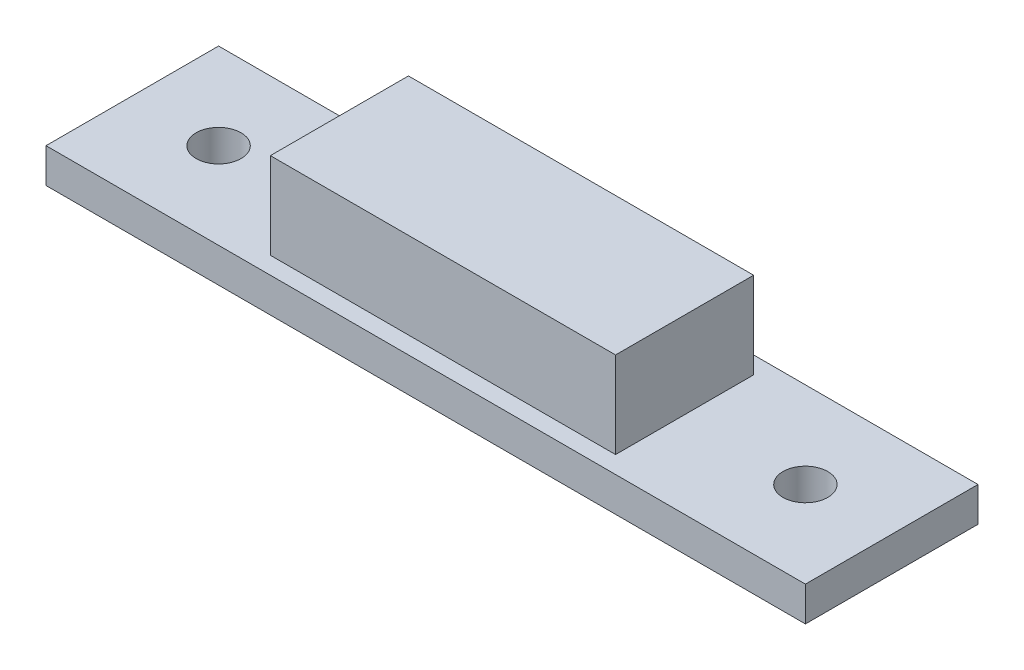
from build123d import *

# Parameters (mm, degrees)
ESQUISSE1_W             = 220
ESQUISSE1_H             = 50
EXTRUSION1_DEPTH        = 10
ESQUISSE2_W             = 100
ESQUISSE2_H             = 40
EXTRUSION2_DEPTH        = 25
ESQUISSE3_R             = 6.5
ENL_V_MAT_EXTRU_1_DEPTH = 25


with BuildPart() as part:
    # Esquisse1 → Extrusion1 (new body)
    with BuildSketch(Plane(origin=(0, 0, 0), x_dir=(1, 0, 0), z_dir=(0, 1, 0))):
        Rectangle(ESQUISSE1_W, ESQUISSE1_H)
    extrude(amount=EXTRUSION1_DEPTH)

    # Esquisse3 → Enl_v. mat.-Extru.1 (cut)
    with BuildSketch(Plane(origin=(0, 10, 0), x_dir=(1, 0, 0), z_dir=(0, 1, 0))):
        with Locations(Location((-85, 0, 0), (0, 0, 270))):
            Circle(ESQUISSE3_R)
        with Locations(Location((85, 0, 0), (0, 0, 270))):
            Circle(ESQUISSE3_R)
    extrude(amount=-ENL_V_MAT_EXTRU_1_DEPTH, mode=Mode.SUBTRACT)


with BuildPart() as body_2:
    # Esquisse2 → Extrusion2 (new body)
    with BuildSketch(Plane(origin=(0, 10, 0), x_dir=(1, 0, 0), z_dir=(0, 1, 0))):
        Rectangle(ESQUISSE2_W, ESQUISSE2_H)
    extrude(amount=EXTRUSION2_DEPTH)


solid = Compound([part.part, body_2.part])
